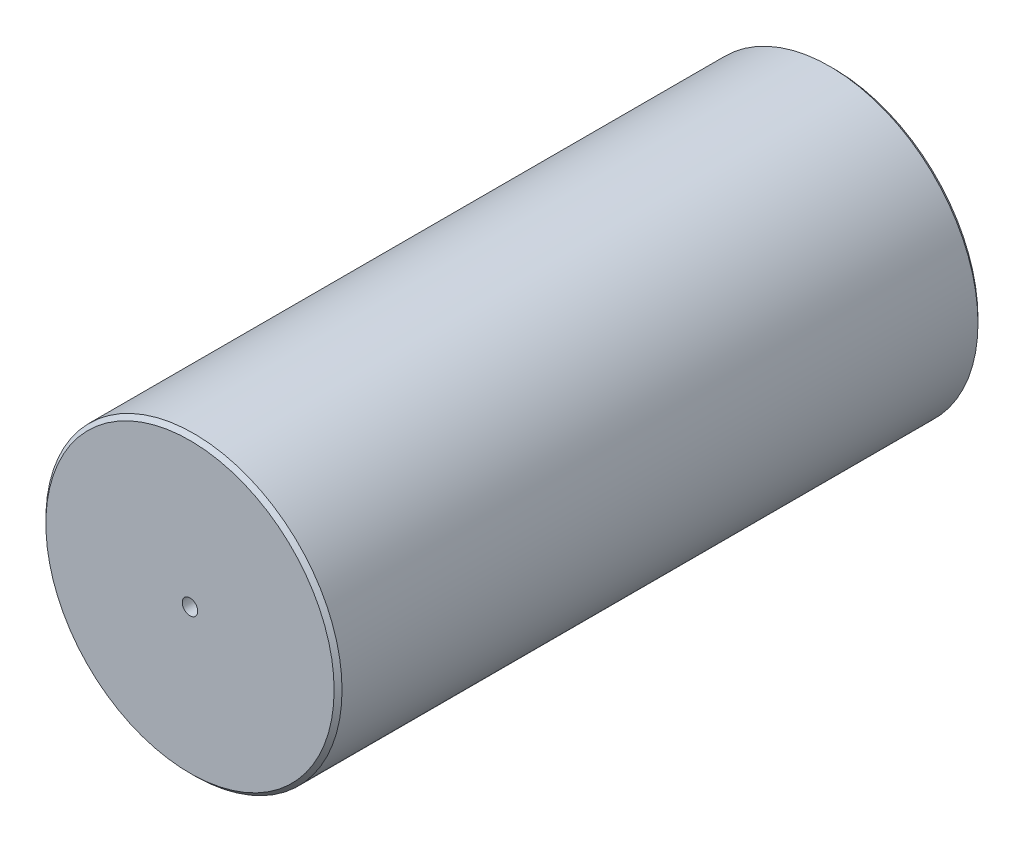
ISO-10303-21;
HEADER;
FILE_DESCRIPTION(('STEP AP214'),'2;1');
FILE_NAME('part.step','',(''),(''),'','','');
FILE_SCHEMA(('AUTOMOTIVE_DESIGN { 1 0 10303 214 1 1 1 1 }'));
ENDSEC;
DATA;
#1=APPLICATION_CONTEXT('core data for automotive mechanical design processes');
#2=APPLICATION_PROTOCOL_DEFINITION('international standard','automotive_design',2000,#1);
#3=PRODUCT_CONTEXT('',#1,'mechanical');
#4=PRODUCT('Part','Part','',(#3));
#5=PRODUCT_RELATED_PRODUCT_CATEGORY('part','',(#4));
#6=PRODUCT_DEFINITION_FORMATION('','',#4);
#7=PRODUCT_DEFINITION_CONTEXT('part definition',#1,'design');
#8=PRODUCT_DEFINITION('design','',#6,#7);
#9=PRODUCT_DEFINITION_SHAPE('','',#8);
#10=(LENGTH_UNIT() NAMED_UNIT(*) SI_UNIT(.MILLI.,.METRE.));
#11=(NAMED_UNIT(*) PLANE_ANGLE_UNIT() SI_UNIT($,.RADIAN.));
#12=(NAMED_UNIT(*) SI_UNIT($,.STERADIAN.) SOLID_ANGLE_UNIT());
#13=UNCERTAINTY_MEASURE_WITH_UNIT(LENGTH_MEASURE(1.E-05),#10,'distance_accuracy_value','');
#14=(GEOMETRIC_REPRESENTATION_CONTEXT(3) GLOBAL_UNCERTAINTY_ASSIGNED_CONTEXT((#13)) GLOBAL_UNIT_ASSIGNED_CONTEXT((#10,
#11,#12)) REPRESENTATION_CONTEXT('',''));
#15=CARTESIAN_POINT('',(0.,0.,0.));
#16=DIRECTION('',(0.,0.,1.));
#17=DIRECTION('',(1.,0.,0.));
#18=AXIS2_PLACEMENT_3D('',#15,#16,#17);
#19=CARTESIAN_POINT('',(0.,0.,82.55));
#20=DIRECTION('',(0.,0.,-1.));
#21=DIRECTION('',(-1.,0.,0.));
#22=AXIS2_PLACEMENT_3D('',#19,#20,#21);
#23=CYLINDRICAL_SURFACE('',#22,18.9865);
#24=CARTESIAN_POINT('',(0.,0.,0.507999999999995));
#25=DIRECTION('',(0.,0.,1.));
#26=DIRECTION('',(1.,0.,0.));
#27=AXIS2_PLACEMENT_3D('',#24,#25,#26);
#28=CIRCLE('',#27,18.9865);
#29=CARTESIAN_POINT('',(18.9865,0.,0.507999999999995));
#30=VERTEX_POINT('',#29);
#31=EDGE_CURVE('E42',#30,#30,#28,.T.);
#32=ORIENTED_EDGE('',*,*,#31,.T.);
#33=EDGE_LOOP('',(#32));
#34=FACE_BOUND('',#33,.T.);
#35=CARTESIAN_POINT('',(0.,0.,82.042));
#36=DIRECTION('',(0.,0.,1.));
#37=DIRECTION('',(1.,0.,0.));
#38=AXIS2_PLACEMENT_3D('',#35,#36,#37);
#39=CIRCLE('',#38,18.9865);
#40=CARTESIAN_POINT('',(18.9865,0.,82.042));
#41=VERTEX_POINT('',#40);
#42=EDGE_CURVE('E46',#41,#41,#39,.F.);
#43=ORIENTED_EDGE('',*,*,#42,.T.);
#44=EDGE_LOOP('',(#43));
#45=FACE_BOUND('',#44,.T.);
#46=ADVANCED_FACE('F31',(#34,#45),#23,.T.);
#47=CARTESIAN_POINT('',(0.,0.,82.55));
#48=DIRECTION('',(0.,0.,1.));
#49=DIRECTION('',(1.,0.,0.));
#50=AXIS2_PLACEMENT_3D('',#47,#48,#49);
#51=PLANE('',#50);
#52=CARTESIAN_POINT('',(0.,0.,82.55));
#53=DIRECTION('',(0.,0.,1.));
#54=DIRECTION('',(1.,0.,0.));
#55=AXIS2_PLACEMENT_3D('',#52,#53,#54);
#56=CIRCLE('',#55,18.4785);
#57=CARTESIAN_POINT('',(18.4785,0.,82.55));
#58=VERTEX_POINT('',#57);
#59=EDGE_CURVE('E10',#58,#58,#56,.T.);
#60=ORIENTED_EDGE('',*,*,#59,.T.);
#61=EDGE_LOOP('',(#60));
#62=FACE_BOUND('',#61,.T.);
#63=CARTESIAN_POINT('',(0.,0.,82.55));
#64=DIRECTION('',(0.,0.,1.));
#65=DIRECTION('',(1.,0.,0.));
#66=AXIS2_PLACEMENT_3D('',#63,#64,#65);
#67=CIRCLE('',#66,0.992250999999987);
#68=CARTESIAN_POINT('',(0.992250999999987,0.,82.55));
#69=VERTEX_POINT('',#68);
#70=EDGE_CURVE('E56',#69,#69,#67,.T.);
#71=ORIENTED_EDGE('',*,*,#70,.F.);
#72=EDGE_LOOP('',(#71));
#73=FACE_BOUND('',#72,.T.);
#74=ADVANCED_FACE('F66',(#62,#73),#51,.T.);
#75=CARTESIAN_POINT('',(0.,0.,0.));
#76=DIRECTION('',(0.,0.,1.));
#77=DIRECTION('',(1.,0.,0.));
#78=AXIS2_PLACEMENT_3D('',#75,#76,#77);
#79=PLANE('',#78);
#80=CARTESIAN_POINT('',(0.,0.,0.));
#81=DIRECTION('',(0.,0.,1.));
#82=DIRECTION('',(1.,0.,0.));
#83=AXIS2_PLACEMENT_3D('',#80,#81,#82);
#84=CIRCLE('',#83,18.4785);
#85=CARTESIAN_POINT('',(18.4785,0.,0.));
#86=VERTEX_POINT('',#85);
#87=EDGE_CURVE('E38',#86,#86,#84,.F.);
#88=ORIENTED_EDGE('',*,*,#87,.T.);
#89=EDGE_LOOP('',(#88));
#90=FACE_BOUND('',#89,.T.);
#91=CARTESIAN_POINT('',(0.,0.,0.));
#92=DIRECTION('',(0.,0.,-1.));
#93=DIRECTION('',(-1.,0.,0.));
#94=AXIS2_PLACEMENT_3D('',#91,#92,#93);
#95=CIRCLE('',#94,12.7);
#96=CARTESIAN_POINT('',(-12.7,0.,0.));
#97=VERTEX_POINT('',#96);
#98=EDGE_CURVE('E55',#97,#97,#95,.T.);
#99=ORIENTED_EDGE('',*,*,#98,.F.);
#100=EDGE_LOOP('',(#99));
#101=FACE_BOUND('',#100,.T.);
#102=ADVANCED_FACE('F68',(#90,#101),#79,.F.);
#103=CARTESIAN_POINT('',(0.,0.,38.1));
#104=DIRECTION('',(0.,0.,-1.));
#105=DIRECTION('',(-1.,0.,0.));
#106=AXIS2_PLACEMENT_3D('',#103,#104,#105);
#107=CYLINDRICAL_SURFACE('',#106,12.7);
#108=CARTESIAN_POINT('',(0.,0.,38.1));
#109=DIRECTION('',(0.,0.,-1.));
#110=DIRECTION('',(-1.,0.,0.));
#111=AXIS2_PLACEMENT_3D('',#108,#109,#110);
#112=CIRCLE('',#111,12.7);
#113=CARTESIAN_POINT('',(-12.7,0.,38.1));
#114=VERTEX_POINT('',#113);
#115=EDGE_CURVE('E51',#114,#114,#112,.T.);
#116=CARTESIAN_POINT('',(-12.7,0.,38.1));
#117=CARTESIAN_POINT('',(-12.7,0.,37.703125));
#118=CARTESIAN_POINT('',(-12.7,0.,37.30625));
#119=CARTESIAN_POINT('',(-12.7,0.,36.5125));
#120=CARTESIAN_POINT('',(-12.7,0.,36.115625));
#121=CARTESIAN_POINT('',(-12.7,0.,35.321875));
#122=CARTESIAN_POINT('',(-12.7,0.,34.925));
#123=CARTESIAN_POINT('',(-12.7,0.,34.13125));
#124=CARTESIAN_POINT('',(-12.7,0.,33.734375));
#125=CARTESIAN_POINT('',(-12.7,0.,32.940625));
#126=CARTESIAN_POINT('',(-12.7,0.,32.54375));
#127=CARTESIAN_POINT('',(-12.7,0.,31.75));
#128=CARTESIAN_POINT('',(-12.7,0.,31.353125));
#129=CARTESIAN_POINT('',(-12.7,0.,30.559375));
#130=CARTESIAN_POINT('',(-12.7,0.,30.1625));
#131=CARTESIAN_POINT('',(-12.7,0.,29.36875));
#132=CARTESIAN_POINT('',(-12.7,0.,28.971875));
#133=CARTESIAN_POINT('',(-12.7,0.,28.178125));
#134=CARTESIAN_POINT('',(-12.7,0.,27.78125));
#135=CARTESIAN_POINT('',(-12.7,0.,26.9875));
#136=CARTESIAN_POINT('',(-12.7,0.,26.590625));
#137=CARTESIAN_POINT('',(-12.7,0.,25.796875));
#138=CARTESIAN_POINT('',(-12.7,0.,25.4));
#139=CARTESIAN_POINT('',(-12.7,0.,24.60625));
#140=CARTESIAN_POINT('',(-12.7,0.,24.209375));
#141=CARTESIAN_POINT('',(-12.7,0.,23.415625));
#142=CARTESIAN_POINT('',(-12.7,0.,23.01875));
#143=CARTESIAN_POINT('',(-12.7,0.,22.225));
#144=CARTESIAN_POINT('',(-12.7,0.,21.828125));
#145=CARTESIAN_POINT('',(-12.7,0.,21.034375));
#146=CARTESIAN_POINT('',(-12.7,0.,20.6375));
#147=CARTESIAN_POINT('',(-12.7,0.,19.84375));
#148=CARTESIAN_POINT('',(-12.7,0.,19.446875));
#149=CARTESIAN_POINT('',(-12.7,0.,18.653125));
#150=CARTESIAN_POINT('',(-12.7,0.,18.25625));
#151=CARTESIAN_POINT('',(-12.7,0.,17.4625));
#152=CARTESIAN_POINT('',(-12.7,0.,17.065625));
#153=CARTESIAN_POINT('',(-12.7,0.,16.271875));
#154=CARTESIAN_POINT('',(-12.7,0.,15.875));
#155=CARTESIAN_POINT('',(-12.7,0.,15.08125));
#156=CARTESIAN_POINT('',(-12.7,0.,14.684375));
#157=CARTESIAN_POINT('',(-12.7,0.,13.890625));
#158=CARTESIAN_POINT('',(-12.7,0.,13.49375));
#159=CARTESIAN_POINT('',(-12.7,0.,12.7));
#160=CARTESIAN_POINT('',(-12.7,0.,12.303125));
#161=CARTESIAN_POINT('',(-12.7,0.,11.509375));
#162=CARTESIAN_POINT('',(-12.7,0.,11.1125));
#163=CARTESIAN_POINT('',(-12.7,0.,10.31875));
#164=CARTESIAN_POINT('',(-12.7,0.,9.921875));
#165=CARTESIAN_POINT('',(-12.7,0.,9.128125));
#166=CARTESIAN_POINT('',(-12.7,0.,8.73125));
#167=CARTESIAN_POINT('',(-12.7,0.,7.9375));
#168=CARTESIAN_POINT('',(-12.7,0.,7.540625));
#169=CARTESIAN_POINT('',(-12.7,0.,6.746875));
#170=CARTESIAN_POINT('',(-12.7,0.,6.35));
#171=CARTESIAN_POINT('',(-12.7,0.,5.55625));
#172=CARTESIAN_POINT('',(-12.7,0.,5.159375));
#173=CARTESIAN_POINT('',(-12.7,0.,4.365625));
#174=CARTESIAN_POINT('',(-12.7,0.,3.96875));
#175=CARTESIAN_POINT('',(-12.7,0.,3.175));
#176=CARTESIAN_POINT('',(-12.7,0.,2.778125));
#177=CARTESIAN_POINT('',(-12.7,0.,1.984375));
#178=CARTESIAN_POINT('',(-12.7,0.,1.5875));
#179=CARTESIAN_POINT('',(-12.7,0.,0.79375));
#180=CARTESIAN_POINT('',(-12.7,0.,0.396875));
#181=CARTESIAN_POINT('',(-12.7,0.,0.));
#182=B_SPLINE_CURVE_WITH_KNOTS('',3,(#116,#117,#118,#119,#120,#121,#122,#123,#124,#125,#126,
#127,#128,#129,#130,#131,#132,#133,#134,#135,#136,#137,#138,#139,#140,#141,#142,#143,#144,#145,
#146,#147,#148,#149,#150,#151,#152,#153,#154,#155,#156,#157,#158,#159,#160,#161,#162,#163,#164,
#165,#166,#167,#168,#169,#170,#171,#172,#173,#174,#175,#176,#177,#178,#179,#180,#181),
.UNSPECIFIED.,.F.,.F.,(4,2,2,2,2,2,2,2,2,2,2,2,2,2,2,2,2,2,2,2,2,2,2,2,2,2,2,2,2,2,2,2,4),(0.,
1.19062499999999,2.38124999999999,3.571875,4.7625,5.953125,7.14375,8.334375,9.525,10.715625,
11.90625,13.096875,14.2875,15.478125,16.66875,17.859375,19.05,20.240625,21.43125,22.621875,
23.8125,25.003125,26.19375,27.384375,28.575,29.765625,30.95625,32.146875,33.3375,34.528125,
35.71875,36.909375,38.1),.UNSPECIFIED.);
#183=EDGE_CURVE('BSEAM74',#114,#97,#182,.T.);
#184=ORIENTED_EDGE('',*,*,#115,.F.);
#185=ORIENTED_EDGE('',*,*,#98,.T.);
#186=ORIENTED_EDGE('',*,*,#183,.T.);
#187=ORIENTED_EDGE('',*,*,#183,.F.);
#188=EDGE_LOOP('',(#184,#186,#185,#187));
#189=FACE_BOUND('',#188,.T.);
#190=ADVANCED_FACE('F74',(#189),#107,.F.);
#191=CARTESIAN_POINT('',(0.,0.,38.1));
#192=DIRECTION('',(0.,0.,-1.));
#193=DIRECTION('',(-1.,0.,0.));
#194=AXIS2_PLACEMENT_3D('',#191,#192,#193);
#195=PLANE('',#194);
#196=CARTESIAN_POINT('',(0.,0.,38.1));
#197=DIRECTION('',(0.,0.,-1.));
#198=DIRECTION('',(-1.,0.,0.));
#199=AXIS2_PLACEMENT_3D('',#196,#197,#198);
#200=CIRCLE('',#199,0.992250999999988);
#201=CARTESIAN_POINT('',(-0.992250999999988,0.,38.1));
#202=VERTEX_POINT('',#201);
#203=EDGE_CURVE('E52',#202,#202,#200,.T.);
#204=ORIENTED_EDGE('',*,*,#203,.F.);
#205=EDGE_LOOP('',(#204));
#206=FACE_BOUND('',#205,.T.);
#207=ORIENTED_EDGE('',*,*,#115,.T.);
#208=EDGE_LOOP('',(#207));
#209=FACE_BOUND('',#208,.T.);
#210=ADVANCED_FACE('F88',(#206,#209),#195,.T.);
#211=CARTESIAN_POINT('',(0.,0.,82.55));
#212=DIRECTION('',(0.,0.,1.));
#213=DIRECTION('',(1.,0.,0.));
#214=AXIS2_PLACEMENT_3D('',#211,#212,#213);
#215=CYLINDRICAL_SURFACE('',#214,0.992250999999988);
#216=ORIENTED_EDGE('',*,*,#203,.T.);
#217=EDGE_LOOP('',(#216));
#218=FACE_BOUND('',#217,.T.);
#219=ORIENTED_EDGE('',*,*,#70,.T.);
#220=EDGE_LOOP('',(#219));
#221=FACE_BOUND('',#220,.T.);
#222=ADVANCED_FACE('F64',(#218,#221),#215,.F.);
#223=CARTESIAN_POINT('',(0.,0.,0.507999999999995));
#224=DIRECTION('',(0.,0.,1.));
#225=DIRECTION('',(1.,0.,0.));
#226=AXIS2_PLACEMENT_3D('',#223,#224,#225);
#227=CONICAL_SURFACE('',#226,18.9865,0.785398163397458);
#228=ORIENTED_EDGE('',*,*,#87,.F.);
#229=EDGE_LOOP('',(#228));
#230=FACE_BOUND('',#229,.T.);
#231=ORIENTED_EDGE('',*,*,#31,.F.);
#232=EDGE_LOOP('',(#231));
#233=FACE_BOUND('',#232,.T.);
#234=ADVANCED_FACE('F80',(#230,#233),#227,.T.);
#235=CARTESIAN_POINT('',(0.,0.,82.55));
#236=DIRECTION('',(0.,0.,-1.));
#237=DIRECTION('',(-1.,0.,0.));
#238=AXIS2_PLACEMENT_3D('',#235,#236,#237);
#239=CONICAL_SURFACE('',#238,18.4785,0.785398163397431);
#240=ORIENTED_EDGE('',*,*,#42,.F.);
#241=EDGE_LOOP('',(#240));
#242=FACE_BOUND('',#241,.T.);
#243=ORIENTED_EDGE('',*,*,#59,.F.);
#244=EDGE_LOOP('',(#243));
#245=FACE_BOUND('',#244,.T.);
#246=ADVANCED_FACE('F33',(#242,#245),#239,.T.);
#247=CLOSED_SHELL('',(#46,#74,#102,#190,#210,#222,#234,#246));
#248=MANIFOLD_SOLID_BREP('B2',#247);
#249=ADVANCED_BREP_SHAPE_REPRESENTATION('',(#18,#248),#14);
#250=SHAPE_DEFINITION_REPRESENTATION(#9,#249);
ENDSEC;
END-ISO-10303-21;
